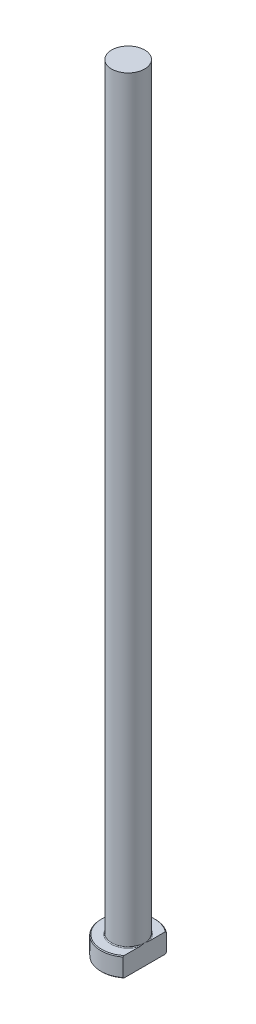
ISO-10303-21;
HEADER;
FILE_DESCRIPTION(('STEP AP214'),'2;1');
FILE_NAME('part.step','',(''),(''),'','','');
FILE_SCHEMA(('AUTOMOTIVE_DESIGN { 1 0 10303 214 1 1 1 1 }'));
ENDSEC;
DATA;
#1=APPLICATION_CONTEXT('core data for automotive mechanical design processes');
#2=APPLICATION_PROTOCOL_DEFINITION('international standard','automotive_design',2000,#1);
#3=PRODUCT_CONTEXT('',#1,'mechanical');
#4=PRODUCT('Part','Part','',(#3));
#5=PRODUCT_RELATED_PRODUCT_CATEGORY('part','',(#4));
#6=PRODUCT_DEFINITION_FORMATION('','',#4);
#7=PRODUCT_DEFINITION_CONTEXT('part definition',#1,'design');
#8=PRODUCT_DEFINITION('design','',#6,#7);
#9=PRODUCT_DEFINITION_SHAPE('','',#8);
#10=(LENGTH_UNIT() NAMED_UNIT(*) SI_UNIT(.MILLI.,.METRE.));
#11=(NAMED_UNIT(*) PLANE_ANGLE_UNIT() SI_UNIT($,.RADIAN.));
#12=(NAMED_UNIT(*) SI_UNIT($,.STERADIAN.) SOLID_ANGLE_UNIT());
#13=UNCERTAINTY_MEASURE_WITH_UNIT(LENGTH_MEASURE(1.E-05),#10,'distance_accuracy_value','');
#14=(GEOMETRIC_REPRESENTATION_CONTEXT(3) GLOBAL_UNCERTAINTY_ASSIGNED_CONTEXT((#13)) GLOBAL_UNIT_ASSIGNED_CONTEXT((#10,
#11,#12)) REPRESENTATION_CONTEXT('',''));
#15=CARTESIAN_POINT('',(0.,0.,0.));
#16=DIRECTION('',(0.,0.,1.));
#17=DIRECTION('',(1.,0.,0.));
#18=AXIS2_PLACEMENT_3D('',#15,#16,#17);
#19=CARTESIAN_POINT('',(0.,0.,0.));
#20=DIRECTION('',(0.,-1.,0.));
#21=DIRECTION('',(0.,0.,-1.));
#22=AXIS2_PLACEMENT_3D('',#19,#20,#21);
#23=PLANE('',#22);
#24=CARTESIAN_POINT('',(0.,0.,0.));
#25=DIRECTION('',(0.,-1.,0.));
#26=DIRECTION('',(0.,0.,-1.));
#27=AXIS2_PLACEMENT_3D('',#24,#25,#26);
#28=CIRCLE('',#27,6.79999999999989);
#29=CARTESIAN_POINT('',(4.24999999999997,0.,5.30824829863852));
#30=VERTEX_POINT('',#29);
#31=CARTESIAN_POINT('',(4.24999999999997,0.,-5.30824829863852));
#32=VERTEX_POINT('',#31);
#33=EDGE_CURVE('E98',#30,#32,#28,.T.);
#34=ORIENTED_EDGE('',*,*,#33,.T.);
#35=DIRECTION('',(0.,0.,1.));
#36=VECTOR('',#35,1.);
#37=CARTESIAN_POINT('',(4.24999999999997,0.,-5.56214886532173));
#38=LINE('',#37,#36);
#39=EDGE_CURVE('E83',#32,#30,#38,.T.);
#40=ORIENTED_EDGE('',*,*,#39,.T.);
#41=EDGE_LOOP('',(#34,#40));
#42=FACE_BOUND('',#41,.T.);
#43=ADVANCED_FACE('F32',(#42),#23,.T.);
#44=CARTESIAN_POINT('',(0.,259.958771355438,0.));
#45=DIRECTION('',(0.,1.,0.));
#46=DIRECTION('',(0.,0.,1.));
#47=AXIS2_PLACEMENT_3D('',#44,#45,#46);
#48=CYLINDRICAL_SURFACE('',#47,6.99999999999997);
#49=CARTESIAN_POINT('',(0.,4.79999999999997,0.));
#50=DIRECTION('',(0.,1.,0.));
#51=DIRECTION('',(0.,0.,1.));
#52=AXIS2_PLACEMENT_3D('',#49,#50,#51);
#53=CIRCLE('',#52,6.99999999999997);
#54=CARTESIAN_POINT('',(4.24999999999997,4.79999999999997,5.56214886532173));
#55=VERTEX_POINT('',#54);
#56=CARTESIAN_POINT('',(4.24999999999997,4.79999999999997,-5.56214886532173));
#57=VERTEX_POINT('',#56);
#58=EDGE_CURVE('E104',#55,#57,#53,.F.);
#59=ORIENTED_EDGE('',*,*,#58,.T.);
#60=DIRECTION('',(0.,-1.,0.));
#61=VECTOR('',#60,1.);
#62=CARTESIAN_POINT('',(4.24999999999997,200.,-5.56214886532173));
#63=LINE('',#62,#61);
#64=CARTESIAN_POINT('',(4.24999999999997,0.200000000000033,-5.56214886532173));
#65=VERTEX_POINT('',#64);
#66=EDGE_CURVE('E183',#57,#65,#63,.T.);
#67=ORIENTED_EDGE('',*,*,#66,.T.);
#68=CARTESIAN_POINT('',(0.,0.200000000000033,0.));
#69=DIRECTION('',(0.,-1.,0.));
#70=DIRECTION('',(0.,0.,-1.));
#71=AXIS2_PLACEMENT_3D('',#68,#69,#70);
#72=CIRCLE('',#71,6.99999999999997);
#73=CARTESIAN_POINT('',(4.24999999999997,0.200000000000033,5.56214886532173));
#74=VERTEX_POINT('',#73);
#75=EDGE_CURVE('E100',#65,#74,#72,.F.);
#76=ORIENTED_EDGE('',*,*,#75,.T.);
#77=DIRECTION('',(0.,-1.,0.));
#78=VECTOR('',#77,1.);
#79=CARTESIAN_POINT('',(4.24999999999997,200.,5.56214886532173));
#80=LINE('',#79,#78);
#81=EDGE_CURVE('E93',#55,#74,#80,.T.);
#82=ORIENTED_EDGE('',*,*,#81,.F.);
#83=EDGE_LOOP('',(#59,#67,#76,#82));
#84=FACE_BOUND('',#83,.T.);
#85=ADVANCED_FACE('F158',(#84),#48,.T.);
#86=CARTESIAN_POINT('',(-6.99999999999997,5.,0.));
#87=DIRECTION('',(0.,1.,0.));
#88=DIRECTION('',(0.,0.,1.));
#89=AXIS2_PLACEMENT_3D('',#86,#87,#88);
#90=PLANE('',#89);
#91=CARTESIAN_POINT('',(0.,5.,0.));
#92=DIRECTION('',(0.,1.,0.));
#93=DIRECTION('',(0.,0.,1.));
#94=AXIS2_PLACEMENT_3D('',#91,#92,#93);
#95=CIRCLE('',#94,6.79999999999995);
#96=CARTESIAN_POINT('',(4.24999999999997,5.,-5.3082482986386));
#97=VERTEX_POINT('',#96);
#98=CARTESIAN_POINT('',(4.24999999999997,5.,5.3082482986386));
#99=VERTEX_POINT('',#98);
#100=EDGE_CURVE('E178',#97,#99,#95,.T.);
#101=ORIENTED_EDGE('',*,*,#100,.T.);
#102=DIRECTION('',(0.,0.,-1.));
#103=VECTOR('',#102,1.);
#104=CARTESIAN_POINT('',(4.24999999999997,5.,0.));
#105=LINE('',#104,#103);
#106=CARTESIAN_POINT('',(4.24999999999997,4.99999999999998,1.31909059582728));
#107=VERTEX_POINT('',#106);
#108=EDGE_CURVE('E57',#99,#107,#105,.T.);
#109=ORIENTED_EDGE('',*,*,#108,.T.);
#110=CARTESIAN_POINT('',(0.,5.,0.));
#111=DIRECTION('',(0.,1.,0.));
#112=DIRECTION('',(0.,0.,1.));
#113=AXIS2_PLACEMENT_3D('',#110,#111,#112);
#114=CIRCLE('',#113,4.44999999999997);
#115=CARTESIAN_POINT('',(4.24999999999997,4.99999999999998,-1.31909059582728));
#116=VERTEX_POINT('',#115);
#117=EDGE_CURVE('E107',#107,#116,#114,.F.);
#118=ORIENTED_EDGE('',*,*,#117,.T.);
#119=EDGE_CURVE('E136',#116,#97,#105,.T.);
#120=ORIENTED_EDGE('',*,*,#119,.T.);
#121=EDGE_LOOP('',(#101,#109,#118,#120));
#122=FACE_BOUND('',#121,.T.);
#123=ADVANCED_FACE('F147',(#122),#90,.T.);
#124=CARTESIAN_POINT('',(0.,5.,0.));
#125=DIRECTION('',(0.,-1.,0.));
#126=DIRECTION('',(0.,0.,-1.));
#127=AXIS2_PLACEMENT_3D('',#124,#125,#126);
#128=CONICAL_SURFACE('',#127,6.79999999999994,0.785398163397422);
#129=ORIENTED_EDGE('',*,*,#58,.F.);
#130=CARTESIAN_POINT('',(4.24999999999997,-1.15497179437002,12.2380061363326));
#131=CARTESIAN_POINT('',(4.24999999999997,-0.968600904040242,12.0407126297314));
#132=CARTESIAN_POINT('',(4.24999999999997,-0.782481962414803,11.843180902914));
#133=CARTESIAN_POINT('',(4.24999999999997,-0.410835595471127,11.4475596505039));
#134=CARTESIAN_POINT('',(4.24999999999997,-0.225308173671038,11.2494701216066));
#135=CARTESIAN_POINT('',(4.24999999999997,0.330615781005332,10.6538566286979));
#136=CARTESIAN_POINT('',(4.24999999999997,0.699987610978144,10.2553749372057));
#137=CARTESIAN_POINT('',(4.24999999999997,1.44820689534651,9.44056382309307));
#138=CARTESIAN_POINT('',(4.24999999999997,1.82691721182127,9.02410803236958));
#139=CARTESIAN_POINT('',(4.24999999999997,2.39038838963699,8.39564122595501));
#140=CARTESIAN_POINT('',(4.24999999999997,2.57736390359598,8.18561642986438));
#141=CARTESIAN_POINT('',(4.24999999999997,2.94948531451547,7.76395344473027));
#142=CARTESIAN_POINT('',(4.24999999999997,3.13463122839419,7.55231527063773));
#143=CARTESIAN_POINT('',(4.24999999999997,3.50243810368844,7.12729701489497));
#144=CARTESIAN_POINT('',(4.24999999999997,3.68510158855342,6.91391912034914));
#145=CARTESIAN_POINT('',(4.24999999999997,4.04753998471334,6.48470257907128));
#146=CARTESIAN_POINT('',(4.24999999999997,4.22731476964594,6.26886382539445));
#147=CARTESIAN_POINT('',(4.24999999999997,4.58362310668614,5.83346482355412));
#148=CARTESIAN_POINT('',(4.24999999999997,4.76014565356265,5.61389554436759));
#149=CARTESIAN_POINT('',(4.24999999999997,5.10813954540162,5.17081545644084));
#150=CARTESIAN_POINT('',(4.24999999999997,5.27961153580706,4.94730515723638));
#151=CARTESIAN_POINT('',(4.24999999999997,5.61292794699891,4.4988347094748));
#152=CARTESIAN_POINT('',(4.24999999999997,5.77488381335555,4.27395773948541));
#153=CARTESIAN_POINT('',(4.24999999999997,6.08959034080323,3.8175542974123));
#154=CARTESIAN_POINT('',(4.24999999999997,6.24233528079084,3.58602382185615));
#155=CARTESIAN_POINT('',(4.24999999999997,6.46088242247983,3.23296927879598));
#156=CARTESIAN_POINT('',(4.24999999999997,6.53180994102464,3.11461948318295));
#157=CARTESIAN_POINT('',(4.24999999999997,6.66953191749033,2.87554671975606));
#158=CARTESIAN_POINT('',(4.24999999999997,6.73632692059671,2.75482406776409));
#159=CARTESIAN_POINT('',(4.24999999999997,6.86480050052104,2.51086229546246));
#160=CARTESIAN_POINT('',(4.24999999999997,6.92648531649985,2.38762647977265));
#161=CARTESIAN_POINT('',(4.24999999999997,7.04367856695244,2.13827051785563));
#162=CARTESIAN_POINT('',(4.24999999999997,7.09918867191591,2.0121511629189));
#163=CARTESIAN_POINT('',(4.24999999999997,7.20212054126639,1.75821381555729));
#164=CARTESIAN_POINT('',(4.24999999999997,7.24962333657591,1.63042897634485));
#165=CARTESIAN_POINT('',(4.24999999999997,7.3357468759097,1.37182854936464));
#166=CARTESIAN_POINT('',(4.24999999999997,7.37436534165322,1.24101219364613));
#167=CARTESIAN_POINT('',(4.24999999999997,7.44090399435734,0.977431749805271));
#168=CARTESIAN_POINT('',(4.24999999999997,7.46888314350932,0.844682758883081));
#169=CARTESIAN_POINT('',(4.24999999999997,7.51300819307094,0.577216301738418));
#170=CARTESIAN_POINT('',(4.24999999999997,7.52915548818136,0.442499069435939));
#171=CARTESIAN_POINT('',(4.24999999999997,7.54874331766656,0.170860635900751));
#172=CARTESIAN_POINT('',(4.24999999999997,7.55206380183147,0.0339306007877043));
#173=CARTESIAN_POINT('',(4.24999999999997,7.54544836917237,-0.239598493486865));
#174=CARTESIAN_POINT('',(4.24999999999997,7.53551276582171,-0.376197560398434));
#175=CARTESIAN_POINT('',(4.24999999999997,7.50295253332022,-0.648437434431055));
#176=CARTESIAN_POINT('',(4.24999999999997,7.48027427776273,-0.784071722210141));
#177=CARTESIAN_POINT('',(4.24999999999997,7.42348982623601,-1.05291460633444));
#178=CARTESIAN_POINT('',(4.24999999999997,7.38938084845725,-1.18612260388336));
#179=CARTESIAN_POINT('',(4.24999999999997,7.29188531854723,-1.51531404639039));
#180=CARTESIAN_POINT('',(4.24999999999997,7.22238075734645,-1.70947814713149));
#181=CARTESIAN_POINT('',(4.24999999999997,7.0666874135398,-2.09097599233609));
#182=CARTESIAN_POINT('',(4.24999999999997,6.9804865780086,-2.27830468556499));
#183=CARTESIAN_POINT('',(4.24999999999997,6.84149476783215,-2.55552751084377));
#184=CARTESIAN_POINT('',(4.24999999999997,6.79327931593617,-2.64776502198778));
#185=CARTESIAN_POINT('',(4.24999999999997,6.69413480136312,-2.83077431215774));
#186=CARTESIAN_POINT('',(4.24999999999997,6.64320570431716,-2.92154607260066));
#187=CARTESIAN_POINT('',(4.24999999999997,6.53904474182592,-3.10170103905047));
#188=CARTESIAN_POINT('',(4.24999999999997,6.48581387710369,-3.1910848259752));
#189=CARTESIAN_POINT('',(4.24999999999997,6.37734720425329,-3.368618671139));
#190=CARTESIAN_POINT('',(4.24999999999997,6.32211148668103,-3.45676878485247));
#191=CARTESIAN_POINT('',(4.24999999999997,6.13027123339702,-3.75631659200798));
#192=CARTESIAN_POINT('',(4.24999999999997,5.98947006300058,-3.96503082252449));
#193=CARTESIAN_POINT('',(4.24999999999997,5.70061349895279,-4.37739745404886));
#194=CARTESIAN_POINT('',(4.24999999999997,5.55255625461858,-4.58104854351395));
#195=CARTESIAN_POINT('',(4.24999999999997,5.25096308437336,-4.98451036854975));
#196=CARTESIAN_POINT('',(4.24999999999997,5.09742258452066,-5.1843176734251));
#197=CARTESIAN_POINT('',(4.24999999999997,4.78630665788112,-5.58072220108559));
#198=CARTESIAN_POINT('',(4.24999999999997,4.62873161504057,-5.77731972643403));
#199=CARTESIAN_POINT('',(4.24999999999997,4.30987074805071,-6.16866624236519));
#200=CARTESIAN_POINT('',(4.24999999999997,4.1485735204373,-6.36340591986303));
#201=CARTESIAN_POINT('',(4.24999999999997,3.8234904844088,-6.75079948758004));
#202=CARTESIAN_POINT('',(4.24999999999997,3.65970462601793,-6.94345333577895));
#203=CARTESIAN_POINT('',(4.24999999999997,3.33022176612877,-7.32695469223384));
#204=CARTESIAN_POINT('',(4.24999999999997,3.16452573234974,-7.51780303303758));
#205=CARTESIAN_POINT('',(4.24999999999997,2.83151234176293,-7.89808083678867));
#206=CARTESIAN_POINT('',(4.24999999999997,2.6641949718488,-8.08751028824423));
#207=CARTESIAN_POINT('',(4.24999999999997,2.19674563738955,-8.61299836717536));
#208=CARTESIAN_POINT('',(4.24999999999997,1.89516668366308,-8.94776953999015));
#209=CARTESIAN_POINT('',(4.24999999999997,1.28890266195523,-9.61456394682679));
#210=CARTESIAN_POINT('',(4.24999999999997,0.984217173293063,-9.94658679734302));
#211=CARTESIAN_POINT('',(4.24999999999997,0.374739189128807,-10.6061264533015));
#212=CARTESIAN_POINT('',(4.24999999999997,0.0699631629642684,-10.9336584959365));
#213=CARTESIAN_POINT('',(4.24999999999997,-0.541317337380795,-11.5870007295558));
#214=CARTESIAN_POINT('',(4.24999999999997,-0.847821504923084,-11.9128112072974));
#215=CARTESIAN_POINT('',(4.24999999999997,-1.15497179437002,-12.2380061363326));
#216=B_SPLINE_CURVE_WITH_KNOTS('',3,(#130,#131,#132,#133,#134,#135,#136,#137,#138,#139,#140,
#141,#142,#143,#144,#145,#146,#147,#148,#149,#150,#151,#152,#153,#154,#155,#156,#157,#158,#159,
#160,#161,#162,#163,#164,#165,#166,#167,#168,#169,#170,#171,#172,#173,#174,#175,#176,#177,#178,
#179,#180,#181,#182,#183,#184,#185,#186,#187,#188,#189,#190,#191,#192,#193,#194,#195,#196,#197,
#198,#199,#200,#201,#202,#203,#204,#205,#206,#207,#208,#209,#210,#211,#212,#213,#214,#215),
.UNSPECIFIED.,.F.,.F.,(4,2,2,2,2,2,2,2,2,2,2,2,2,2,2,2,2,2,2,2,2,2,2,2,2,2,2,2,2,2,2,2,2,2,2,2,
2,2,2,2,2,2,4),(0.,0.814204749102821,1.62841433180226,3.25843263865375,4.94708916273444,
5.79066412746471,6.63423128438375,7.47686481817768,8.31953511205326,9.16466757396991,
10.0096915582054,10.8409260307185,11.6726715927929,12.0865355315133,12.500344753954,
12.9136410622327,13.3268252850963,13.7355380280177,14.1443554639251,14.5508730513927,
14.9573427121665,15.3676075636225,15.777862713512,16.1898574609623,16.6019525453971,
17.2195383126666,17.8375715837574,18.1497730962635,18.461978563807,18.7740496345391,
19.0861066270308,19.8411596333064,20.5964062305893,21.3522982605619,22.1081186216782,
22.8666854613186,23.6252675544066,24.3834808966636,25.141700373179,26.4934084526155,
27.845302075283,29.1874909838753,30.5294487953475),.UNSPECIFIED.);
#217=EDGE_CURVE('E135',#55,#99,#216,.T.);
#218=ORIENTED_EDGE('',*,*,#217,.T.);
#219=ORIENTED_EDGE('',*,*,#100,.F.);
#220=EDGE_CURVE('E127',#97,#57,#216,.T.);
#221=ORIENTED_EDGE('',*,*,#220,.T.);
#222=EDGE_LOOP('',(#129,#218,#219,#221));
#223=FACE_BOUND('',#222,.T.);
#224=ADVANCED_FACE('F143',(#223),#128,.T.);
#225=CARTESIAN_POINT('',(0.,0.200000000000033,0.));
#226=DIRECTION('',(0.,1.,0.));
#227=DIRECTION('',(0.,0.,1.));
#228=AXIS2_PLACEMENT_3D('',#225,#226,#227);
#229=CONICAL_SURFACE('',#228,6.99999999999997,0.785398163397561);
#230=ORIENTED_EDGE('',*,*,#75,.F.);
#231=CARTESIAN_POINT('',(4.24999999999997,6.15497179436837,-12.2380061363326));
#232=CARTESIAN_POINT('',(4.24999999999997,5.96860090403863,-12.0407126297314));
#233=CARTESIAN_POINT('',(4.24999999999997,5.78248196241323,-11.843180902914));
#234=CARTESIAN_POINT('',(4.24999999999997,5.41083559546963,-11.4475596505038));
#235=CARTESIAN_POINT('',(4.24999999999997,5.22530817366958,-11.2494701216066));
#236=CARTESIAN_POINT('',(4.24999999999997,4.66938421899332,-10.6538566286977));
#237=CARTESIAN_POINT('',(4.24999999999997,4.30001238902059,-10.2553749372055));
#238=CARTESIAN_POINT('',(4.24999999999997,3.55179310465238,-9.44056382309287));
#239=CARTESIAN_POINT('',(4.24999999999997,3.17308278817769,-9.02410803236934));
#240=CARTESIAN_POINT('',(4.24999999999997,2.60961161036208,-8.39564122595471));
#241=CARTESIAN_POINT('',(4.24999999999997,2.42263609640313,-8.18561642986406));
#242=CARTESIAN_POINT('',(4.24999999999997,2.05051468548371,-7.76395344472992));
#243=CARTESIAN_POINT('',(4.24999999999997,1.86536877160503,-7.55231527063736));
#244=CARTESIAN_POINT('',(4.24999999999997,1.49756189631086,-7.12729701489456));
#245=CARTESIAN_POINT('',(4.24999999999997,1.31489841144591,-6.91391912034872));
#246=CARTESIAN_POINT('',(4.24999999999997,0.952460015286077,-6.48470257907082));
#247=CARTESIAN_POINT('',(4.24999999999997,0.772685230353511,-6.26886382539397));
#248=CARTESIAN_POINT('',(4.24999999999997,0.416376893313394,-5.83346482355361));
#249=CARTESIAN_POINT('',(4.24999999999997,0.239854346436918,-5.61389554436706));
#250=CARTESIAN_POINT('',(4.24999999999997,-0.108139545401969,-5.17081545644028));
#251=CARTESIAN_POINT('',(4.24999999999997,-0.279611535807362,-4.9473051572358));
#252=CARTESIAN_POINT('',(4.24999999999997,-0.612927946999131,-4.49883470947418));
#253=CARTESIAN_POINT('',(4.24999999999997,-0.77488381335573,-4.27395773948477));
#254=CARTESIAN_POINT('',(4.24999999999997,-1.08959034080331,-3.81755429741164));
#255=CARTESIAN_POINT('',(4.24999999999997,-1.24233528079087,-3.58602382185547));
#256=CARTESIAN_POINT('',(4.24999999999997,-1.46088242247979,-3.23296927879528));
#257=CARTESIAN_POINT('',(4.24999999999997,-1.53180994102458,-3.11461948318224));
#258=CARTESIAN_POINT('',(4.24999999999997,-1.66953191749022,-2.87554671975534));
#259=CARTESIAN_POINT('',(4.24999999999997,-1.73632692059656,-2.75482406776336));
#260=CARTESIAN_POINT('',(4.24999999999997,-1.86480050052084,-2.51086229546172));
#261=CARTESIAN_POINT('',(4.24999999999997,-1.92648531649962,-2.3876264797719));
#262=CARTESIAN_POINT('',(4.24999999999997,-2.04367856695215,-2.13827051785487));
#263=CARTESIAN_POINT('',(4.24999999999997,-2.09918867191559,-2.01215116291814));
#264=CARTESIAN_POINT('',(4.24999999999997,-2.20212054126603,-1.75821381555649));
#265=CARTESIAN_POINT('',(4.24999999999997,-2.24962333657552,-1.63042897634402));
#266=CARTESIAN_POINT('',(4.24999999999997,-2.33574687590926,-1.37182854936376));
#267=CARTESIAN_POINT('',(4.24999999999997,-2.37436534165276,-1.24101219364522));
#268=CARTESIAN_POINT('',(4.24999999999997,-2.44090399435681,-0.977431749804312));
#269=CARTESIAN_POINT('',(4.24999999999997,-2.46888314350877,-0.844682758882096));
#270=CARTESIAN_POINT('',(4.24999999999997,-2.51300819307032,-0.577216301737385));
#271=CARTESIAN_POINT('',(4.24999999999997,-2.5291554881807,-0.442499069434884));
#272=CARTESIAN_POINT('',(4.24999999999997,-2.54874331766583,-0.170860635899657));
#273=CARTESIAN_POINT('',(4.24999999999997,-2.55206380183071,-0.0339306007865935));
#274=CARTESIAN_POINT('',(4.24999999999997,-2.54544836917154,0.239598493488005));
#275=CARTESIAN_POINT('',(4.24999999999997,-2.53551276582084,0.376197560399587));
#276=CARTESIAN_POINT('',(4.24999999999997,-2.50295253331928,0.648437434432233));
#277=CARTESIAN_POINT('',(4.24999999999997,-2.48027427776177,0.78407172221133));
#278=CARTESIAN_POINT('',(4.24999999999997,-2.42348982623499,1.05291460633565));
#279=CARTESIAN_POINT('',(4.24999999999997,-2.3893808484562,1.18612260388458));
#280=CARTESIAN_POINT('',(4.24999999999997,-2.29188531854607,1.51531404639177));
#281=CARTESIAN_POINT('',(4.24999999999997,-2.22238075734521,1.70947814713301));
#282=CARTESIAN_POINT('',(4.24999999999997,-2.06668741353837,2.0909759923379));
#283=CARTESIAN_POINT('',(4.24999999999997,-1.98048657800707,2.27830468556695));
#284=CARTESIAN_POINT('',(4.24999999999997,-1.84149476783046,2.55552751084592));
#285=CARTESIAN_POINT('',(4.24999999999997,-1.79327931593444,2.64776502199));
#286=CARTESIAN_POINT('',(4.24999999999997,-1.69413480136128,2.8307743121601));
#287=CARTESIAN_POINT('',(4.24999999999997,-1.64320570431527,2.92154607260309));
#288=CARTESIAN_POINT('',(4.24999999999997,-1.53904474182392,3.10170103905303));
#289=CARTESIAN_POINT('',(4.24999999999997,-1.48581387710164,3.19108482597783));
#290=CARTESIAN_POINT('',(4.24999999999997,-1.37734720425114,3.36861867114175));
#291=CARTESIAN_POINT('',(4.24999999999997,-1.32211148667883,3.4567687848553));
#292=CARTESIAN_POINT('',(4.24999999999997,-1.13027123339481,3.75631659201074));
#293=CARTESIAN_POINT('',(4.24999999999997,-0.989470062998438,3.96503082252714));
#294=CARTESIAN_POINT('',(4.24999999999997,-0.700613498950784,4.37739745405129));
#295=CARTESIAN_POINT('',(4.24999999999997,-0.552556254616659,4.58104854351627));
#296=CARTESIAN_POINT('',(4.24999999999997,-0.250963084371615,4.98451036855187));
#297=CARTESIAN_POINT('',(4.24999999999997,-0.0974225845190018,5.18431767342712));
#298=CARTESIAN_POINT('',(4.24999999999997,0.213693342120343,5.58072220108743));
#299=CARTESIAN_POINT('',(4.24999999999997,0.371268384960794,5.77731972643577));
#300=CARTESIAN_POINT('',(4.24999999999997,0.690129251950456,6.16866624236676));
#301=CARTESIAN_POINT('',(4.24999999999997,0.851426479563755,6.36340591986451));
#302=CARTESIAN_POINT('',(4.24999999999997,1.17650951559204,6.75079948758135));
#303=CARTESIAN_POINT('',(4.24999999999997,1.3402953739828,6.94345333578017));
#304=CARTESIAN_POINT('',(4.24999999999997,1.66977823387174,7.3269546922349));
#305=CARTESIAN_POINT('',(4.24999999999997,1.83547426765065,7.51780303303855));
#306=CARTESIAN_POINT('',(4.24999999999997,2.16848765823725,7.89808083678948));
#307=CARTESIAN_POINT('',(4.24999999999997,2.33580502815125,8.08751028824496));
#308=CARTESIAN_POINT('',(4.24999999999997,2.80325436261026,8.61299836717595));
#309=CARTESIAN_POINT('',(4.24999999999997,3.1048333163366,8.94776953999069));
#310=CARTESIAN_POINT('',(4.24999999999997,3.71109733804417,9.6145639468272));
#311=CARTESIAN_POINT('',(4.24999999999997,4.01578282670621,9.94658679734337));
#312=CARTESIAN_POINT('',(4.24999999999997,4.6252608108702,10.6061264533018));
#313=CARTESIAN_POINT('',(4.24999999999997,4.93003683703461,10.9336584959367));
#314=CARTESIAN_POINT('',(4.24999999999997,5.54131733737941,11.5870007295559));
#315=CARTESIAN_POINT('',(4.24999999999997,5.84782150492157,11.9128112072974));
#316=CARTESIAN_POINT('',(4.24999999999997,6.15497179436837,12.2380061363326));
#317=B_SPLINE_CURVE_WITH_KNOTS('',3,(#231,#232,#233,#234,#235,#236,#237,#238,#239,#240,#241,
#242,#243,#244,#245,#246,#247,#248,#249,#250,#251,#252,#253,#254,#255,#256,#257,#258,#259,#260,
#261,#262,#263,#264,#265,#266,#267,#268,#269,#270,#271,#272,#273,#274,#275,#276,#277,#278,#279,
#280,#281,#282,#283,#284,#285,#286,#287,#288,#289,#290,#291,#292,#293,#294,#295,#296,#297,#298,
#299,#300,#301,#302,#303,#304,#305,#306,#307,#308,#309,#310,#311,#312,#313,#314,#315,#316),
.UNSPECIFIED.,.F.,.F.,(4,2,2,2,2,2,2,2,2,2,2,2,2,2,2,2,2,2,2,2,2,2,2,2,2,2,2,2,2,2,2,2,2,2,2,2,
2,2,2,2,2,2,4),(0.,0.814204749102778,1.62841433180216,3.25843263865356,4.94708916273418,
5.79066412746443,6.63423128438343,7.47686481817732,8.31953511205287,9.16466757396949,
10.009691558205,10.840926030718,11.6726715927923,12.0865355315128,12.5003447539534,
12.9136410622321,13.3268252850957,13.7355380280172,14.1443554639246,14.5508730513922,
14.957342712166,15.3676075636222,15.7778627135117,16.189857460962,16.6019525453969,
17.2195383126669,17.8375715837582,18.1497730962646,18.4619785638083,18.7740496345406,
19.0861066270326,19.8411596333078,20.5964062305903,21.3522982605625,22.1081186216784,
22.8666854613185,23.625267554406,24.3834808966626,25.1417003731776,26.4934084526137,
27.8453020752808,29.1874909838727,30.5294487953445),.UNSPECIFIED.);
#318=EDGE_CURVE('E86',#65,#32,#317,.T.);
#319=ORIENTED_EDGE('',*,*,#318,.T.);
#320=ORIENTED_EDGE('',*,*,#33,.F.);
#321=EDGE_CURVE('E89',#30,#74,#317,.T.);
#322=ORIENTED_EDGE('',*,*,#321,.T.);
#323=EDGE_LOOP('',(#230,#319,#320,#322));
#324=FACE_BOUND('',#323,.T.);
#325=ADVANCED_FACE('F97',(#324),#229,.T.);
#326=CARTESIAN_POINT('',(0.,5.19999999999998,0.));
#327=DIRECTION('',(0.,1.,0.));
#328=DIRECTION('',(0.,0.,1.));
#329=AXIS2_PLACEMENT_3D('',#326,#327,#328);
#330=TOROIDAL_SURFACE('',#329,4.44999999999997,0.2);
#331=CARTESIAN_POINT('',(4.24999999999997,5.19999999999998,0.));
#332=CARTESIAN_POINT('',(4.24999999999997,5.20000051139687,1.15744821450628E-10));
#333=CARTESIAN_POINT('',(4.24999999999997,5.20000102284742,-2.4293169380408E-07));
#334=CARTESIAN_POINT('',(4.24999999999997,5.20000197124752,-8.87321860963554E-07));
#335=CARTESIAN_POINT('',(4.24999999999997,5.20000238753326,-1.30614850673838E-06));
#336=CARTESIAN_POINT('',(4.24999999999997,5.20000327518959,-2.31752643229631E-06));
#337=CARTESIAN_POINT('',(4.24999999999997,5.20000373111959,-2.92646131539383E-06));
#338=CARTESIAN_POINT('',(4.24999999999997,5.200004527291,-4.16981951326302E-06));
#339=CARTESIAN_POINT('',(4.24999999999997,5.2000048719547,-4.80170872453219E-06));
#340=CARTESIAN_POINT('',(4.24999999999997,5.20000620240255,-7.3194814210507E-06));
#341=CARTESIAN_POINT('',(4.24999999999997,5.20000712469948,-9.24257745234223E-06));
#342=CARTESIAN_POINT('',(4.24999999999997,5.20000859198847,-1.29952261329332E-05));
#343=CARTESIAN_POINT('',(4.24999999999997,5.20000916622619,-1.48137375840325E-05));
#344=CARTESIAN_POINT('',(4.24999999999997,5.20001166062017,-2.2701068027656E-05));
#345=CARTESIAN_POINT('',(4.24999999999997,5.20001358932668,-2.87689532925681E-05));
#346=CARTESIAN_POINT('',(4.24999999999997,5.20001634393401,-4.00958698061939E-05));
#347=CARTESIAN_POINT('',(4.24999999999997,5.20001729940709,-4.53228601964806E-05));
#348=CARTESIAN_POINT('',(4.24999999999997,5.20002438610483,-8.47086375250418E-05));
#349=CARTESIAN_POINT('',(4.24999999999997,5.20002990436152,-0.000118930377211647));
#350=CARTESIAN_POINT('',(4.24999999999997,5.20005405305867,-0.000255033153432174));
#351=CARTESIAN_POINT('',(4.24999999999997,5.20007694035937,-0.00035616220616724));
#352=CARTESIAN_POINT('',(4.24999999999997,5.20016675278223,-0.000759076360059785));
#353=CARTESIAN_POINT('',(4.24999999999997,5.20023104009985,-0.00106124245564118));
#354=CARTESIAN_POINT('',(4.24999999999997,5.20048990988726,-0.00226975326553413));
#355=CARTESIAN_POINT('',(4.24999999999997,5.20068789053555,-0.00317558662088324));
#356=CARTESIAN_POINT('',(4.24999999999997,5.20151472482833,-0.00696787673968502));
#357=CARTESIAN_POINT('',(4.24999999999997,5.2021393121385,-0.00985497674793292));
#358=CARTESIAN_POINT('',(4.24999999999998,5.21047485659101,-0.0483744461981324));
#359=CARTESIAN_POINT('',(4.24999999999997,5.21821166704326,-0.0840032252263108));
#360=CARTESIAN_POINT('',(4.24999999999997,5.23443934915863,-0.15925743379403));
#361=CARTESIAN_POINT('',(4.24999999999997,5.24291807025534,-0.198885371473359));
#362=CARTESIAN_POINT('',(4.24999999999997,5.25719269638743,-0.266483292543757));
#363=CARTESIAN_POINT('',(4.24999999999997,5.2630418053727,-0.294441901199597));
#364=CARTESIAN_POINT('',(4.24999999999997,5.27443459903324,-0.349631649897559));
#365=CARTESIAN_POINT('',(4.24999999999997,5.27998226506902,-0.37686197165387));
#366=CARTESIAN_POINT('',(4.24999999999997,5.29789349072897,-0.466265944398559));
#367=CARTESIAN_POINT('',(4.24999999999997,5.3098841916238,-0.528515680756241));
#368=CARTESIAN_POINT('',(4.24999999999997,5.33255488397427,-0.653873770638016));
#369=CARTESIAN_POINT('',(4.24999999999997,5.34322118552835,-0.716984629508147));
#370=CARTESIAN_POINT('',(4.24999999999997,5.36341886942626,-0.849542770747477));
#371=CARTESIAN_POINT('',(4.24999999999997,5.37274606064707,-0.919022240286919));
#372=CARTESIAN_POINT('',(4.24999999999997,5.38787342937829,-1.05816998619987));
#373=CARTESIAN_POINT('',(4.24999999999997,5.39368393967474,-1.12783709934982));
#374=CARTESIAN_POINT('',(4.24999999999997,5.40022105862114,-1.26519903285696));
#375=CARTESIAN_POINT('',(4.24999999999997,5.40110718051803,-1.33288413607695));
#376=CARTESIAN_POINT('',(4.24999999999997,5.39715260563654,-1.43372383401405));
#377=CARTESIAN_POINT('',(4.24999999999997,5.39498924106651,-1.46697561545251));
#378=CARTESIAN_POINT('',(4.24999999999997,5.38843757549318,-1.53323057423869));
#379=CARTESIAN_POINT('',(4.24999999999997,5.38405165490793,-1.56623397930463));
#380=CARTESIAN_POINT('',(4.24999999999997,5.37221191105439,-1.63225744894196));
#381=CARTESIAN_POINT('',(4.24999999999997,5.36471302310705,-1.665270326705));
#382=CARTESIAN_POINT('',(4.24999999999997,5.35002141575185,-1.71373529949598));
#383=CARTESIAN_POINT('',(4.24999999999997,5.3445543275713,-1.72970598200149));
#384=CARTESIAN_POINT('',(4.24999999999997,5.33212858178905,-1.76104662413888));
#385=CARTESIAN_POINT('',(4.24999999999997,5.32517291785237,-1.77641771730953));
#386=CARTESIAN_POINT('',(4.24999999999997,5.31157493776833,-1.80173413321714));
#387=CARTESIAN_POINT('',(4.24999999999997,5.30543892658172,-1.81194868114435));
#388=CARTESIAN_POINT('',(4.24999999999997,5.29187259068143,-1.83147712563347));
#389=CARTESIAN_POINT('',(4.24999999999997,5.28444659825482,-1.84079387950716));
#390=CARTESIAN_POINT('',(4.24999999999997,5.27165788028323,-1.8539962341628));
#391=CARTESIAN_POINT('',(4.24999999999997,5.26687308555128,-1.85843752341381));
#392=CARTESIAN_POINT('',(4.24999999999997,5.25674280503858,-1.86663816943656));
#393=CARTESIAN_POINT('',(4.24999999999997,5.25139780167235,-1.87039810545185));
#394=CARTESIAN_POINT('',(4.24999999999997,5.24121545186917,-1.87633128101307));
#395=CARTESIAN_POINT('',(4.24999999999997,5.23647607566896,-1.87867040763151));
#396=CARTESIAN_POINT('',(4.24999999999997,5.22667692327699,-1.88254109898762));
#397=CARTESIAN_POINT('',(4.24999999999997,5.22161755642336,-1.88407367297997));
#398=CARTESIAN_POINT('',(4.24999999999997,5.21125115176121,-1.88618376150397));
#399=CARTESIAN_POINT('',(4.24999999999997,5.20594232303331,-1.8867527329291));
#400=CARTESIAN_POINT('',(4.24999999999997,5.1953165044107,-1.88683483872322));
#401=CARTESIAN_POINT('',(4.24999999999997,5.18999951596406,-1.88634814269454));
#402=CARTESIAN_POINT('',(4.24999999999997,5.18024254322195,-1.88451305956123));
#403=CARTESIAN_POINT('',(4.24999999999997,5.17577879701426,-1.88328567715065));
#404=CARTESIAN_POINT('',(4.24999999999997,5.16708370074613,-1.88018632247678));
#405=CARTESIAN_POINT('',(4.24999999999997,5.16285244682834,-1.87831408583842));
#406=CARTESIAN_POINT('',(4.24999999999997,5.15236530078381,-1.8728422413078));
#407=CARTESIAN_POINT('',(4.24999999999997,5.14630821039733,-1.86886321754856));
#408=CARTESIAN_POINT('',(4.24999999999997,5.13488065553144,-1.8600173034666));
#409=CARTESIAN_POINT('',(4.24999999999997,5.12951236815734,-1.85514771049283));
#410=CARTESIAN_POINT('',(4.24999999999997,5.11550691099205,-1.84083719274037));
#411=CARTESIAN_POINT('',(4.24999999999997,5.10752788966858,-1.83075903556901));
#412=CARTESIAN_POINT('',(4.24999999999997,5.09305704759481,-1.80961650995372));
#413=CARTESIAN_POINT('',(4.24999999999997,5.08656786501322,-1.7985504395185));
#414=CARTESIAN_POINT('',(4.24999999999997,5.07270261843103,-1.77195183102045));
#415=CARTESIAN_POINT('',(4.24999999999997,5.06578110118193,-1.75618509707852));
#416=CARTESIAN_POINT('',(4.24999999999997,5.05343494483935,-1.72406513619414));
#417=CARTESIAN_POINT('',(4.24999999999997,5.04801326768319,-1.70771081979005));
#418=CARTESIAN_POINT('',(4.24999999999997,5.03828568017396,-1.67446840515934));
#419=CARTESIAN_POINT('',(4.24999999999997,5.03399373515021,-1.65757628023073));
#420=CARTESIAN_POINT('',(4.24999999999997,5.02638165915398,-1.62359857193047));
#421=CARTESIAN_POINT('',(4.24999999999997,5.02306049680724,-1.60651321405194));
#422=CARTESIAN_POINT('',(4.24999999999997,5.01554103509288,-1.56237813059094));
#423=CARTESIAN_POINT('',(4.24999999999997,5.01193061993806,-1.53522860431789));
#424=CARTESIAN_POINT('',(4.24999999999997,5.00624732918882,-1.48076491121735));
#425=CARTESIAN_POINT('',(4.24999999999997,5.00417529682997,-1.45345066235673));
#426=CARTESIAN_POINT('',(4.24999999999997,4.99980704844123,-1.37123328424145));
#427=CARTESIAN_POINT('',(4.24999999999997,4.99938405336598,-1.31623108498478));
#428=CARTESIAN_POINT('',(4.24999999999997,5.00195512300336,-1.20937484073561));
#429=CARTESIAN_POINT('',(4.24999999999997,5.00476235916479,-1.15751417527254));
#430=CARTESIAN_POINT('',(4.24999999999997,5.01274020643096,-1.05395255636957));
#431=CARTESIAN_POINT('',(4.24999999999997,5.0179120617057,-1.00225170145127));
#432=CARTESIAN_POINT('',(4.24999999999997,5.0318667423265,-0.883772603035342));
#433=CARTESIAN_POINT('',(4.24999999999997,5.04126554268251,-0.817068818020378));
#434=CARTESIAN_POINT('',(4.24999999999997,5.06248695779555,-0.68230638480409));
#435=CARTESIAN_POINT('',(4.24999999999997,5.0743654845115,-0.614256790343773));
#436=CARTESIAN_POINT('',(4.24999999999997,5.09582131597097,-0.499048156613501));
#437=CARTESIAN_POINT('',(4.24999999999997,5.10500357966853,-0.451814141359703));
#438=CARTESIAN_POINT('',(4.24999999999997,5.1237965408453,-0.357991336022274));
#439=CARTESIAN_POINT('',(4.24999999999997,5.13340116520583,-0.311401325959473));
#440=CARTESIAN_POINT('',(4.24999999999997,5.15180561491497,-0.223687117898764));
#441=CARTESIAN_POINT('',(4.24999999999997,5.16056968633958,-0.182555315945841));
#442=CARTESIAN_POINT('',(4.24999999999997,5.178640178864,-0.0985301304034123));
#443=CARTESIAN_POINT('',(4.24999999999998,5.18795357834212,-0.0556381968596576));
#444=CARTESIAN_POINT('',(4.24999999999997,5.1978622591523,-0.00984762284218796));
#445=CARTESIAN_POINT('',(4.24999999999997,5.19848844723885,-0.00695317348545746));
#446=CARTESIAN_POINT('',(4.24999999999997,5.1993156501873,-0.00315924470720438));
#447=CARTESIAN_POINT('',(4.24999999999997,5.19951238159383,-0.00225911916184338));
#448=CARTESIAN_POINT('',(4.24999999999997,5.19976973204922,-0.00105770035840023));
#449=CARTESIAN_POINT('',(4.24999999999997,5.19983372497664,-0.000756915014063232));
#450=CARTESIAN_POINT('',(4.24999999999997,5.19992318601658,-0.000355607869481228));
#451=CARTESIAN_POINT('',(4.24999999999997,5.19994602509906,-0.000254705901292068));
#452=CARTESIAN_POINT('',(4.24999999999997,5.1999701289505,-0.000118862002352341));
#453=CARTESIAN_POINT('',(4.24999999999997,5.19997564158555,-8.4670569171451E-05));
#454=CARTESIAN_POINT('',(4.24999999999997,5.19998271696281,-4.53159337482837E-05));
#455=CARTESIAN_POINT('',(4.24999999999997,5.19998367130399,-4.00904844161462E-05));
#456=CARTESIAN_POINT('',(4.24999999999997,5.19998642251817,-2.87668536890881E-05));
#457=CARTESIAN_POINT('',(4.24999999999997,5.19998834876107,-2.27006335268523E-05));
#458=CARTESIAN_POINT('',(4.24999999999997,5.19999084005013,-1.48150638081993E-05));
#459=CARTESIAN_POINT('',(4.24999999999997,5.199991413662,-1.29966656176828E-05));
#460=CARTESIAN_POINT('',(4.24999999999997,5.19999287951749,-9.24415318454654E-06));
#461=CARTESIAN_POINT('',(4.24999999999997,5.19999380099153,-7.32106390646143E-06));
#462=CARTESIAN_POINT('',(4.24999999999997,5.19999513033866,-4.8031966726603E-06));
#463=CARTESIAN_POINT('',(4.24999999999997,5.19999547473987,-4.17124743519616E-06));
#464=CARTESIAN_POINT('',(4.24999999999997,5.19999627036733,-2.92772184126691E-06));
#465=CARTESIAN_POINT('',(4.24999999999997,5.19999672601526,-2.31867707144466E-06));
#466=CARTESIAN_POINT('',(4.24999999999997,5.19999761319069,-1.30704757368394E-06));
#467=CARTESIAN_POINT('',(4.24999999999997,5.19999802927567,-8.88090030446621E-07));
#468=CARTESIAN_POINT('',(4.24999999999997,5.19999897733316,-2.43359811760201E-07));
#469=CARTESIAN_POINT('',(4.24999999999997,5.19999948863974,-1.15736528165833E-10));
#470=CARTESIAN_POINT('',(4.24999999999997,5.19999999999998,0.));
#471=B_SPLINE_CURVE_WITH_KNOTS('',3,(#331,#332,#333,#334,#335,#336,#337,#338,#339,#340,#341,
#342,#343,#344,#345,#346,#347,#348,#349,#350,#351,#352,#353,#354,#355,#356,#357,#358,#359,#360,
#361,#362,#363,#364,#365,#366,#367,#368,#369,#370,#371,#372,#373,#374,#375,#376,#377,#378,#379,
#380,#381,#382,#383,#384,#385,#386,#387,#388,#389,#390,#391,#392,#393,#394,#395,#396,#397,#398,
#399,#400,#401,#402,#403,#404,#405,#406,#407,#408,#409,#410,#411,#412,#413,#414,#415,#416,#417,
#418,#419,#420,#421,#422,#423,#424,#425,#426,#427,#428,#429,#430,#431,#432,#433,#434,#435,#436,
#437,#438,#439,#440,#441,#442,#443,#444,#445,#446,#447,#448,#449,#450,#451,#452,#453,#454,#455,
#456,#457,#458,#459,#460,#461,#462,#463,#464,#465,#466,#467,#468,#469,#470),.UNSPECIFIED.,.T.,
.F.,(4,2,2,2,2,2,2,2,2,2,2,2,2,2,2,2,2,2,2,2,2,2,2,2,2,2,2,2,2,2,2,2,2,2,2,2,2,2,2,2,2,2,2,2,2,
2,2,2,2,2,2,2,2,2,2,2,2,2,2,2,2,2,2,2,2,2,2,2,2,4),(0.,1.56348638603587E-06,
3.34736003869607E-06,5.61252474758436E-06,7.7714730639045E-06,1.41498338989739E-05,
1.98654803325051E-05,3.89412506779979E-05,5.48646730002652E-05,0.000158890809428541,
0.000469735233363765,0.00139675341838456,0.00417812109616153,0.0130401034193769,
0.122414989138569,0.243989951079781,0.329681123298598,0.413050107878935,0.603220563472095,
0.795216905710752,1.00545960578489,1.21508152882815,1.41787186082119,1.51777979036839,
1.61758094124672,1.71888023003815,1.76947366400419,1.81996629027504,1.85565144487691,
1.89121899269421,1.91076085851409,1.93028603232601,1.94608264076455,1.9618594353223,
1.97777538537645,1.99368877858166,2.00752120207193,2.02135930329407,2.04297559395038,
2.06465860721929,2.10300421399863,2.14141720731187,2.19295510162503,2.24459405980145,
2.29684419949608,2.34903862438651,2.43114134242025,2.51328903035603,2.67811431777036,
2.83386590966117,2.98969954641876,3.19173551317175,3.39894587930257,3.54329728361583,
3.68600406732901,3.81216982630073,3.94384090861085,3.95272545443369,3.9554892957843,
3.9564120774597,3.95672222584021,3.95682615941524,3.95684207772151,3.95686114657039,
3.95686686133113,3.9568732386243,3.95687539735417,3.95687766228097,3.95687944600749,
3.95688100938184),.UNSPECIFIED.);
#472=CARTESIAN_POINT('',(4.24999999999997,5.19999999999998,0.));
#473=VERTEX_POINT('',#472);
#474=EDGE_CURVE('E11',#116,#473,#471,.T.);
#475=ORIENTED_EDGE('',*,*,#474,.F.);
#476=ORIENTED_EDGE('',*,*,#117,.F.);
#477=CARTESIAN_POINT('',(4.24999999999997,5.19999999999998,0.));
#478=CARTESIAN_POINT('',(4.24999999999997,5.1999994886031,-1.15744598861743E-10));
#479=CARTESIAN_POINT('',(4.24999999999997,5.19999897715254,2.42931693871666E-07));
#480=CARTESIAN_POINT('',(4.24999999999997,5.19999802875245,8.87321860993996E-07));
#481=CARTESIAN_POINT('',(4.24999999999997,5.1999976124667,1.30614850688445E-06));
#482=CARTESIAN_POINT('',(4.24999999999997,5.19999672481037,2.31752643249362E-06));
#483=CARTESIAN_POINT('',(4.24999999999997,5.19999626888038,2.92646131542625E-06));
#484=CARTESIAN_POINT('',(4.24999999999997,5.19999547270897,4.16981951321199E-06));
#485=CARTESIAN_POINT('',(4.24999999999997,5.19999512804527,4.8017087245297E-06));
#486=CARTESIAN_POINT('',(4.24999999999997,5.19999379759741,7.31948142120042E-06));
#487=CARTESIAN_POINT('',(4.24999999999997,5.19999287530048,9.24257745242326E-06));
#488=CARTESIAN_POINT('',(4.24999999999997,5.1999914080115,1.29952261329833E-05));
#489=CARTESIAN_POINT('',(4.24999999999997,5.19999083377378,1.48137375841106E-05));
#490=CARTESIAN_POINT('',(4.24999999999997,5.19998833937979,2.27010680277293E-05));
#491=CARTESIAN_POINT('',(4.24999999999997,5.19998641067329,2.87689532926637E-05));
#492=CARTESIAN_POINT('',(4.24999999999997,5.19998365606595,4.00958698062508E-05));
#493=CARTESIAN_POINT('',(4.24999999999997,5.19998270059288,4.53228601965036E-05));
#494=CARTESIAN_POINT('',(4.24999999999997,5.19997561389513,8.47086375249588E-05));
#495=CARTESIAN_POINT('',(4.24999999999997,5.19997009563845,0.000118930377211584));
#496=CARTESIAN_POINT('',(4.24999999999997,5.19994594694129,0.000255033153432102));
#497=CARTESIAN_POINT('',(4.24999999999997,5.1999230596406,0.000356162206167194));
#498=CARTESIAN_POINT('',(4.24999999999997,5.19983324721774,0.000759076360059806));
#499=CARTESIAN_POINT('',(4.24999999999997,5.19976895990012,0.00106124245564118));
#500=CARTESIAN_POINT('',(4.24999999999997,5.19951009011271,0.00226975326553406));
#501=CARTESIAN_POINT('',(4.24999999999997,5.19931210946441,0.00317558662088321));
#502=CARTESIAN_POINT('',(4.24999999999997,5.19848527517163,0.00696787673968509));
#503=CARTESIAN_POINT('',(4.24999999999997,5.19786068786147,0.00985497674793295));
#504=CARTESIAN_POINT('',(4.24999999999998,5.18952514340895,0.0483744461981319));
#505=CARTESIAN_POINT('',(4.24999999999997,5.1817883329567,0.0840032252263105));
#506=CARTESIAN_POINT('',(4.24999999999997,5.16556065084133,0.15925743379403));
#507=CARTESIAN_POINT('',(4.24999999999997,5.15708192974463,0.198885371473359));
#508=CARTESIAN_POINT('',(4.24999999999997,5.14280730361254,0.266483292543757));
#509=CARTESIAN_POINT('',(4.24999999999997,5.13695819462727,0.294441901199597));
#510=CARTESIAN_POINT('',(4.24999999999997,5.12556540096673,0.349631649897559));
#511=CARTESIAN_POINT('',(4.24999999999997,5.12001773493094,0.37686197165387));
#512=CARTESIAN_POINT('',(4.24999999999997,5.10210650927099,0.466265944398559));
#513=CARTESIAN_POINT('',(4.24999999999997,5.09011580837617,0.528515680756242));
#514=CARTESIAN_POINT('',(4.24999999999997,5.0674451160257,0.653873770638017));
#515=CARTESIAN_POINT('',(4.24999999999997,5.05677881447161,0.716984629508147));
#516=CARTESIAN_POINT('',(4.24999999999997,5.0365811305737,0.849542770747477));
#517=CARTESIAN_POINT('',(4.24999999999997,5.0272539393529,0.919022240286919));
#518=CARTESIAN_POINT('',(4.24999999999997,5.01212657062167,1.05816998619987));
#519=CARTESIAN_POINT('',(4.24999999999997,5.00631606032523,1.12783709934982));
#520=CARTESIAN_POINT('',(4.24999999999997,4.99977894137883,1.26519903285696));
#521=CARTESIAN_POINT('',(4.24999999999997,4.99889281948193,1.33288413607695));
#522=CARTESIAN_POINT('',(4.24999999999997,5.00284739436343,1.43372383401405));
#523=CARTESIAN_POINT('',(4.24999999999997,5.00501075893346,1.46697561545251));
#524=CARTESIAN_POINT('',(4.24999999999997,5.01156242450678,1.53323057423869));
#525=CARTESIAN_POINT('',(4.24999999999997,5.01594834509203,1.56623397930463));
#526=CARTESIAN_POINT('',(4.24999999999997,5.02778808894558,1.63225744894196));
#527=CARTESIAN_POINT('',(4.24999999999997,5.03528697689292,1.665270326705));
#528=CARTESIAN_POINT('',(4.24999999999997,5.04997858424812,1.71373529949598));
#529=CARTESIAN_POINT('',(4.24999999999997,5.05544567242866,1.72970598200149));
#530=CARTESIAN_POINT('',(4.24999999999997,5.06787141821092,1.76104662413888));
#531=CARTESIAN_POINT('',(4.24999999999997,5.0748270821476,1.77641771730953));
#532=CARTESIAN_POINT('',(4.24999999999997,5.08842506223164,1.80173413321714));
#533=CARTESIAN_POINT('',(4.24999999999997,5.09456107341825,1.81194868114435));
#534=CARTESIAN_POINT('',(4.24999999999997,5.10812740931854,1.83147712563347));
#535=CARTESIAN_POINT('',(4.24999999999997,5.11555340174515,1.84079387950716));
#536=CARTESIAN_POINT('',(4.24999999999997,5.12834211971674,1.8539962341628));
#537=CARTESIAN_POINT('',(4.24999999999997,5.13312691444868,1.85843752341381));
#538=CARTESIAN_POINT('',(4.24999999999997,5.14325719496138,1.86663816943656));
#539=CARTESIAN_POINT('',(4.24999999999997,5.14860219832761,1.87039810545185));
#540=CARTESIAN_POINT('',(4.24999999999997,5.15878454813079,1.87633128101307));
#541=CARTESIAN_POINT('',(4.24999999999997,5.16352392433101,1.87867040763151));
#542=CARTESIAN_POINT('',(4.24999999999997,5.17332307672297,1.88254109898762));
#543=CARTESIAN_POINT('',(4.24999999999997,5.17838244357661,1.88407367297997));
#544=CARTESIAN_POINT('',(4.24999999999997,5.18874884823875,1.88618376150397));
#545=CARTESIAN_POINT('',(4.24999999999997,5.19405767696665,1.8867527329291));
#546=CARTESIAN_POINT('',(4.24999999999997,5.20468349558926,1.88683483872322));
#547=CARTESIAN_POINT('',(4.24999999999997,5.2100004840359,1.88634814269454));
#548=CARTESIAN_POINT('',(4.24999999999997,5.21975745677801,1.88451305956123));
#549=CARTESIAN_POINT('',(4.24999999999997,5.2242212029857,1.88328567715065));
#550=CARTESIAN_POINT('',(4.24999999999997,5.23291629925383,1.88018632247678));
#551=CARTESIAN_POINT('',(4.24999999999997,5.23714755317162,1.87831408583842));
#552=CARTESIAN_POINT('',(4.24999999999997,5.24763469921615,1.8728422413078));
#553=CARTESIAN_POINT('',(4.24999999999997,5.25369178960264,1.86886321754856));
#554=CARTESIAN_POINT('',(4.24999999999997,5.26511934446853,1.8600173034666));
#555=CARTESIAN_POINT('',(4.24999999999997,5.27048763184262,1.85514771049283));
#556=CARTESIAN_POINT('',(4.24999999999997,5.28449308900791,1.84083719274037));
#557=CARTESIAN_POINT('',(4.24999999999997,5.29247211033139,1.83075903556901));
#558=CARTESIAN_POINT('',(4.24999999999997,5.30694295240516,1.80961650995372));
#559=CARTESIAN_POINT('',(4.24999999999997,5.31343213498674,1.7985504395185));
#560=CARTESIAN_POINT('',(4.24999999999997,5.32729738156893,1.77195183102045));
#561=CARTESIAN_POINT('',(4.24999999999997,5.33421889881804,1.75618509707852));
#562=CARTESIAN_POINT('',(4.24999999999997,5.34656505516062,1.72406513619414));
#563=CARTESIAN_POINT('',(4.24999999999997,5.35198673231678,1.70771081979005));
#564=CARTESIAN_POINT('',(4.24999999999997,5.361714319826,1.67446840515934));
#565=CARTESIAN_POINT('',(4.24999999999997,5.36600626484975,1.65757628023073));
#566=CARTESIAN_POINT('',(4.24999999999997,5.37361834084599,1.62359857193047));
#567=CARTESIAN_POINT('',(4.24999999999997,5.37693950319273,1.60651321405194));
#568=CARTESIAN_POINT('',(4.24999999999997,5.38445896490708,1.56237813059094));
#569=CARTESIAN_POINT('',(4.24999999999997,5.38806938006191,1.53522860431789));
#570=CARTESIAN_POINT('',(4.24999999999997,5.39375267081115,1.48076491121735));
#571=CARTESIAN_POINT('',(4.24999999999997,5.39582470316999,1.45345066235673));
#572=CARTESIAN_POINT('',(4.24999999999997,5.40019295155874,1.37123328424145));
#573=CARTESIAN_POINT('',(4.24999999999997,5.40061594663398,1.31623108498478));
#574=CARTESIAN_POINT('',(4.24999999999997,5.3980448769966,1.20937484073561));
#575=CARTESIAN_POINT('',(4.24999999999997,5.39523764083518,1.15751417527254));
#576=CARTESIAN_POINT('',(4.24999999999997,5.387259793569,1.05395255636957));
#577=CARTESIAN_POINT('',(4.24999999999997,5.38208793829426,1.00225170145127));
#578=CARTESIAN_POINT('',(4.24999999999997,5.36813325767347,0.883772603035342));
#579=CARTESIAN_POINT('',(4.24999999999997,5.35873445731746,0.817068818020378));
#580=CARTESIAN_POINT('',(4.24999999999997,5.33751304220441,0.68230638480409));
#581=CARTESIAN_POINT('',(4.24999999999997,5.32563451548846,0.614256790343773));
#582=CARTESIAN_POINT('',(4.24999999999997,5.304178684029,0.499048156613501));
#583=CARTESIAN_POINT('',(4.24999999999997,5.29499642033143,0.451814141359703));
#584=CARTESIAN_POINT('',(4.24999999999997,5.27620345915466,0.357991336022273));
#585=CARTESIAN_POINT('',(4.24999999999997,5.26659883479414,0.311401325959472));
#586=CARTESIAN_POINT('',(4.24999999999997,5.248194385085,0.223687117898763));
#587=CARTESIAN_POINT('',(4.24999999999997,5.23943031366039,0.182555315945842));
#588=CARTESIAN_POINT('',(4.24999999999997,5.22135982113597,0.0985301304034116));
#589=CARTESIAN_POINT('',(4.24999999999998,5.21204642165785,0.0556381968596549));
#590=CARTESIAN_POINT('',(4.24999999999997,5.20213774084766,0.00984762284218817));
#591=CARTESIAN_POINT('',(4.24999999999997,5.20151155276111,0.00695317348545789));
#592=CARTESIAN_POINT('',(4.24999999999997,5.20068434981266,0.00315924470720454));
#593=CARTESIAN_POINT('',(4.24999999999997,5.20048761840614,0.00225911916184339));
#594=CARTESIAN_POINT('',(4.24999999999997,5.20023026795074,0.00105770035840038));
#595=CARTESIAN_POINT('',(4.24999999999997,5.20016627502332,0.000756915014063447));
#596=CARTESIAN_POINT('',(4.24999999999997,5.20007681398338,0.00035560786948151));
#597=CARTESIAN_POINT('',(4.24999999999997,5.20005397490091,0.000254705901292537));
#598=CARTESIAN_POINT('',(4.24999999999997,5.20002987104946,0.000118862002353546));
#599=CARTESIAN_POINT('',(4.24999999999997,5.20002435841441,8.467056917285E-05));
#600=CARTESIAN_POINT('',(4.24999999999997,5.20001728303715,4.53159337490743E-05));
#601=CARTESIAN_POINT('',(4.24999999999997,5.20001632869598,4.00904844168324E-05));
#602=CARTESIAN_POINT('',(4.24999999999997,5.2000135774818,2.87668536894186E-05));
#603=CARTESIAN_POINT('',(4.24999999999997,5.20001165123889,2.27006335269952E-05));
#604=CARTESIAN_POINT('',(4.24999999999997,5.20000915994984,1.48150638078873E-05));
#605=CARTESIAN_POINT('',(4.24999999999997,5.20000858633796,1.29966656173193E-05));
#606=CARTESIAN_POINT('',(4.24999999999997,5.20000712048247,9.24415318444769E-06));
#607=CARTESIAN_POINT('',(4.24999999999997,5.20000619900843,7.3210639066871E-06));
#608=CARTESIAN_POINT('',(4.24999999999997,5.20000486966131,4.80319667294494E-06));
#609=CARTESIAN_POINT('',(4.24999999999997,5.20000452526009,4.17124743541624E-06));
#610=CARTESIAN_POINT('',(4.24999999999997,5.20000372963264,2.92772184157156E-06));
#611=CARTESIAN_POINT('',(4.24999999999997,5.20000327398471,2.31867707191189E-06));
#612=CARTESIAN_POINT('',(4.24999999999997,5.20000238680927,1.30704757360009E-06));
#613=CARTESIAN_POINT('',(4.24999999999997,5.2000019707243,8.88090029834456E-07));
#614=CARTESIAN_POINT('',(4.24999999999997,5.20000102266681,2.43359811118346E-07));
#615=CARTESIAN_POINT('',(4.24999999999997,5.20000051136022,1.15736305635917E-10));
#616=CARTESIAN_POINT('',(4.24999999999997,5.19999999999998,0.));
#617=B_SPLINE_CURVE_WITH_KNOTS('',3,(#477,#478,#479,#480,#481,#482,#483,#484,#485,#486,#487,
#488,#489,#490,#491,#492,#493,#494,#495,#496,#497,#498,#499,#500,#501,#502,#503,#504,#505,#506,
#507,#508,#509,#510,#511,#512,#513,#514,#515,#516,#517,#518,#519,#520,#521,#522,#523,#524,#525,
#526,#527,#528,#529,#530,#531,#532,#533,#534,#535,#536,#537,#538,#539,#540,#541,#542,#543,#544,
#545,#546,#547,#548,#549,#550,#551,#552,#553,#554,#555,#556,#557,#558,#559,#560,#561,#562,#563,
#564,#565,#566,#567,#568,#569,#570,#571,#572,#573,#574,#575,#576,#577,#578,#579,#580,#581,#582,
#583,#584,#585,#586,#587,#588,#589,#590,#591,#592,#593,#594,#595,#596,#597,#598,#599,#600,#601,
#602,#603,#604,#605,#606,#607,#608,#609,#610,#611,#612,#613,#614,#615,#616),.UNSPECIFIED.,.T.,
.F.,(4,2,2,2,2,2,2,2,2,2,2,2,2,2,2,2,2,2,2,2,2,2,2,2,2,2,2,2,2,2,2,2,2,2,2,2,2,2,2,2,2,2,2,2,2,
2,2,2,2,2,2,2,2,2,2,2,2,2,2,2,2,2,2,2,2,2,2,2,2,4),(0.,1.56348638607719E-06,3.3473600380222E-06,
5.61252474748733E-06,7.77147306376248E-06,1.41498338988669E-05,1.9865480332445E-05,
3.89412506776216E-05,5.48646729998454E-05,0.000158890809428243,0.000469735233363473,
0.00139675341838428,0.00417812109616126,0.0130401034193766,0.122414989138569,0.243989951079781,
0.329681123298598,0.413050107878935,0.603220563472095,0.795216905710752,1.00545960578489,
1.21508152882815,1.41787186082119,1.51777979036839,1.61758094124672,1.71888023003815,
1.76947366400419,1.81996629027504,1.85565144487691,1.89121899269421,1.91076085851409,
1.93028603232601,1.94608264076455,1.9618594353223,1.97777538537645,1.99368877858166,
2.00752120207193,2.02135930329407,2.04297559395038,2.06465860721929,2.10300421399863,
2.14141720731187,2.19295510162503,2.24459405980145,2.29684419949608,2.34903862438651,
2.43114134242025,2.51328903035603,2.67811431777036,2.83386590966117,2.98969954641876,
3.19173551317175,3.39894587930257,3.54329728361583,3.68600406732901,3.81216982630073,
3.94384090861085,3.95272545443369,3.9554892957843,3.9564120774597,3.95672222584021,
3.95682615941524,3.95684207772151,3.95686114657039,3.95686686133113,3.9568732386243,
3.95687539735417,3.95687766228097,3.95687944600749,3.95688100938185),.UNSPECIFIED.);
#618=EDGE_CURVE('E46',#473,#107,#617,.T.);
#619=ORIENTED_EDGE('',*,*,#618,.F.);
#620=CARTESIAN_POINT('',(0.,5.19999999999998,0.));
#621=DIRECTION('',(0.,1.,0.));
#622=DIRECTION('',(0.,0.,1.));
#623=AXIS2_PLACEMENT_3D('',#620,#621,#622);
#624=CIRCLE('',#623,4.24999999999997);
#625=EDGE_CURVE('E103',#473,#473,#624,.T.);
#626=ORIENTED_EDGE('',*,*,#625,.F.);
#627=EDGE_LOOP('',(#475,#476,#619,#626));
#628=FACE_BOUND('',#627,.T.);
#629=ADVANCED_FACE('F34',(#628),#330,.F.);
#630=CARTESIAN_POINT('',(0.,259.958771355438,0.));
#631=DIRECTION('',(0.,1.,0.));
#632=DIRECTION('',(0.,0.,1.));
#633=AXIS2_PLACEMENT_3D('',#630,#631,#632);
#634=CYLINDRICAL_SURFACE('',#633,4.24999999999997);
#635=ORIENTED_EDGE('',*,*,#625,.T.);
#636=EDGE_LOOP('',(#635));
#637=FACE_BOUND('',#636,.T.);
#638=CARTESIAN_POINT('',(0.,200.,0.));
#639=DIRECTION('',(0.,1.,0.));
#640=DIRECTION('',(0.,0.,1.));
#641=AXIS2_PLACEMENT_3D('',#638,#639,#640);
#642=CIRCLE('',#641,4.24999999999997);
#643=CARTESIAN_POINT('',(0.,200.,4.24999999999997));
#644=VERTEX_POINT('',#643);
#645=EDGE_CURVE('E101',#644,#644,#642,.T.);
#646=ORIENTED_EDGE('',*,*,#645,.F.);
#647=EDGE_LOOP('',(#646));
#648=FACE_BOUND('',#647,.T.);
#649=ADVANCED_FACE('F155',(#637,#648),#634,.T.);
#650=CARTESIAN_POINT('',(-4.24999999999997,200.,0.));
#651=DIRECTION('',(0.,1.,0.));
#652=DIRECTION('',(0.,0.,1.));
#653=AXIS2_PLACEMENT_3D('',#650,#651,#652);
#654=PLANE('',#653);
#655=ORIENTED_EDGE('',*,*,#645,.T.);
#656=EDGE_LOOP('',(#655));
#657=FACE_BOUND('',#656,.T.);
#658=ADVANCED_FACE('F121',(#657),#654,.T.);
#659=CARTESIAN_POINT('',(4.24999999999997,200.,-5.56214886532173));
#660=DIRECTION('',(1.,0.,0.));
#661=DIRECTION('',(0.,0.,-1.));
#662=AXIS2_PLACEMENT_3D('',#659,#660,#661);
#663=PLANE('',#662);
#664=ORIENTED_EDGE('',*,*,#66,.F.);
#665=ORIENTED_EDGE('',*,*,#220,.F.);
#666=ORIENTED_EDGE('',*,*,#119,.F.);
#667=ORIENTED_EDGE('',*,*,#474,.T.);
#668=ORIENTED_EDGE('',*,*,#618,.T.);
#669=ORIENTED_EDGE('',*,*,#108,.F.);
#670=ORIENTED_EDGE('',*,*,#217,.F.);
#671=ORIENTED_EDGE('',*,*,#81,.T.);
#672=ORIENTED_EDGE('',*,*,#321,.F.);
#673=ORIENTED_EDGE('',*,*,#39,.F.);
#674=ORIENTED_EDGE('',*,*,#318,.F.);
#675=EDGE_LOOP('',(#664,#665,#666,#667,#668,#669,#670,#671,#672,#673,#674));
#676=FACE_BOUND('',#675,.T.);
#677=ADVANCED_FACE('F85',(#676),#663,.T.);
#678=CLOSED_SHELL('',(#43,#85,#123,#224,#325,#629,#649,#658,#677));
#679=MANIFOLD_SOLID_BREP('B2',#678);
#680=ADVANCED_BREP_SHAPE_REPRESENTATION('',(#18,#679),#14);
#681=SHAPE_DEFINITION_REPRESENTATION(#9,#680);
ENDSEC;
END-ISO-10303-21;
